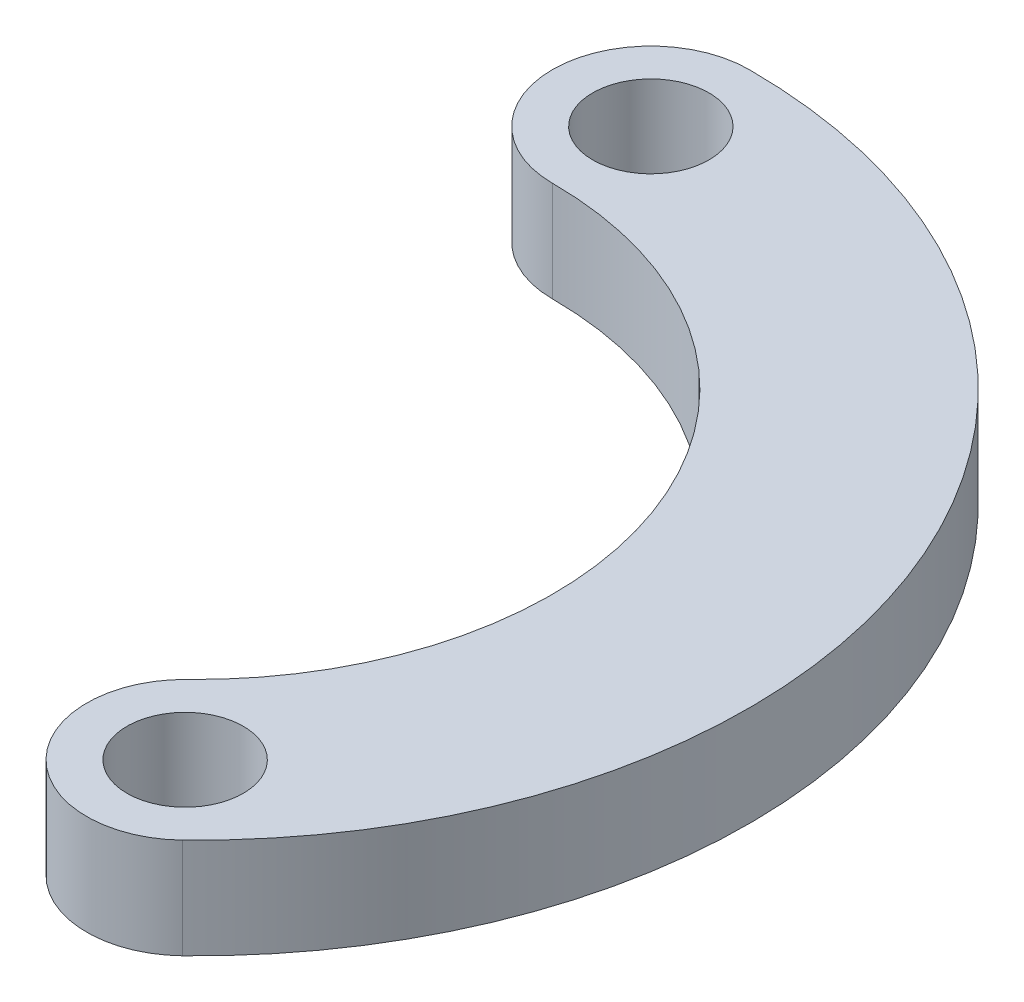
from build123d import *

# Parameters (mm, degrees)
ESTRUSIONE_ESTRUSIONE1_DEPTH = 2.8
SCHIZZO3_R                   = 1.625
TAGLIO_ESTRUSIONE1_DEPTH     = 23.028277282


with BuildPart() as part:
    # Schizzo1 → Estrusione-Estrusione1 (new body)
    with BuildSketch(Plane(origin=(0, 0, 0), x_dir=(1, 0, 0), z_dir=(0, 1, 0))):
        with BuildLine():
            Line((0, 12.183185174), (0, 9.95))
            ThreePointArc((0, 9.95), (7.035712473, 7.035712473), (9.95, 0))
            ThreePointArc((9.95, 0), (9.159023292, -3.887774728), (6.911850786, -7.157431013))
            ThreePointArc((6.911850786, -7.157431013), (6.843976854, -11.045925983), (10.732471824, -11.113799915))
            ThreePointArc((10.732471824, -11.113799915), (14.221799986, -6.036795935), (15.45, 0))
            ThreePointArc((15.45, 0), (10.924799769, 10.924799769), (0, 15.45))
            Line((0, 15.45), (0, 12.183185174))
        make_face()
        with BuildLine():
            ThreePointArc((0, 15.45), (-2.75, 12.7), (0, 9.95))
            Line((0, 9.95), (0, 12.183185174))
            Line((0, 12.183185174), (0, 15.45))
        make_face()
    extrude(amount=-ESTRUSIONE_ESTRUSIONE1_DEPTH)

    # Schizzo3 → Taglio-Estrusione1 (cut, through all)
    with BuildSketch(Plane(origin=(0, 0, 0), x_dir=(1, 0, 0), z_dir=(0, 1, 0))):
        with Locations(Location((0, 12.7, 0), (0, 0, 270))):
            Circle(SCHIZZO3_R)
        with Locations(Location((8.822161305, -9.135615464, 0), (0, 0, 270))):
            Circle(SCHIZZO3_R)
    extrude(amount=-TAGLIO_ESTRUSIONE1_DEPTH, mode=Mode.SUBTRACT)


solid = part.part
